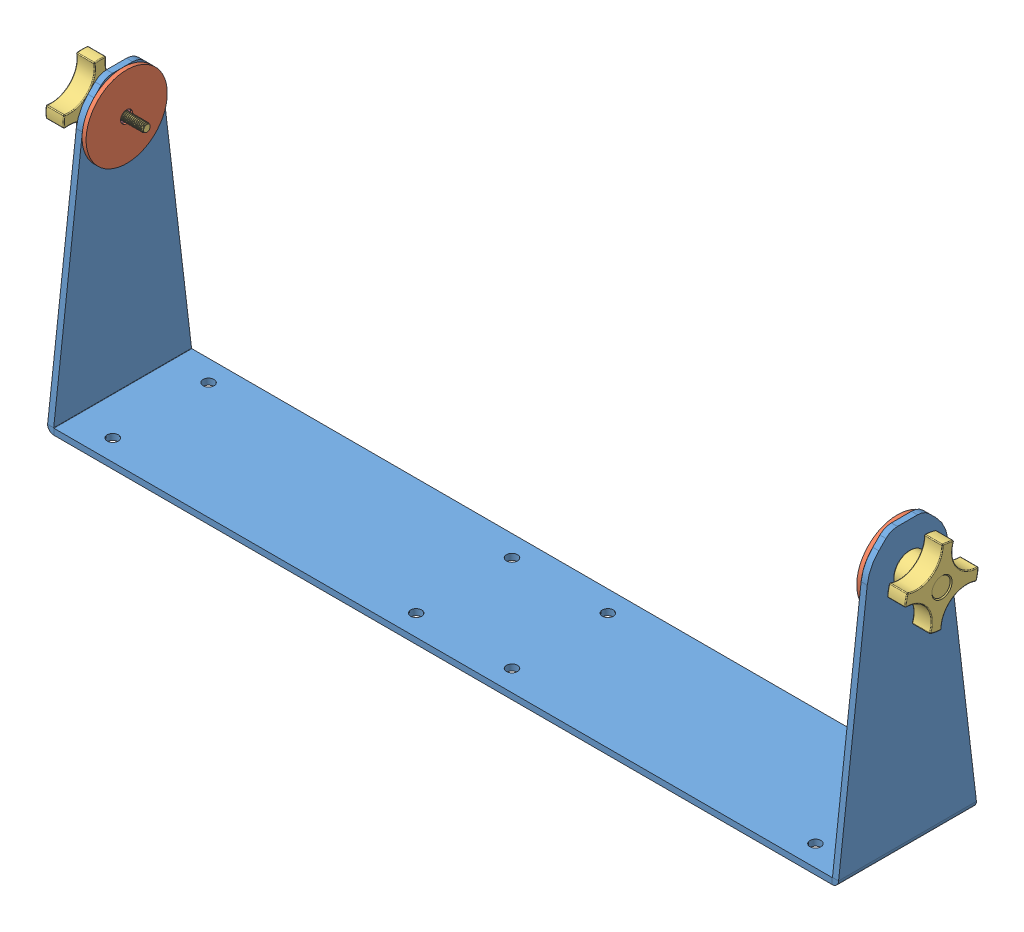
SolidWorks assembly All Wall Yoke Configurations, YWxx.SLDASM, configuration YW23.8 (file format 13000). Lengths in mm.
Overall size (673.13 227.28 107.95).
7 component instances, 4 part files, 12 mates.
Components (placement in the parent):
- All Wall Yoke Configurations, YWxx-1: All Wall Yoke Configurations, YWxx.SLDPRT [YW23.8] at origin size (619.12 222.25 107.95)
- Rubber Washer, 10177-1: Rubber Washer, 10177.sldprt [Default] at (-304.7873 382.5534 -179.6315) x (0 0 -1) z (1 0 0)
- Knob, 30053-1: Knob, 30053.sldprt [Default] at (-298.4627 190.5 0) x (0 0 1) z (-1 0 0)
- Rubber Washer, 10177-2: Rubber Washer, 10177.sldprt [Default] at (304.7873 46.9472 220.3283) x (0 -0.984808 0.173648) z (-1 0 0)
- Knob, 30053-2: Knob, 30053.sldprt [Default] at (298.4627 190.5 0) x (0 0.984808 -0.173648) z (1 0 0)
- Bushing, 30501-1: Bushing, 30501.sldprt [Default] at (-309.5625 190.5 0) x (0 0 1) z (-1 0 0)
- Bushing, 30501-2: Bushing, 30501.sldprt [Default] at (309.5625 190.5 0) x (0 0.984808 -0.173648) z (1 0 0)
Mates (geometry in assembly coordinates):
- Coincident1: coincident anti-aligned: plane of All Wall Yoke Configurations, YWxx-1 through (-304.7873 190.5 0) normal (1 0 0); plane of Rubber Washer, 10177-1 through (-304.7873 190.5 -2.5664) normal (-1 0 0)
- Concentric1: concentric aligned: cylinder of All Wall Yoke Configurations, YWxx-1 through (-309.5625 190.5 0) axis (1 0 0) radius 4.9657; cylinder of Rubber Washer, 10177-1 through (-304.7873 190.5 0) axis (1 0 0) radius 4.7625
- Distance1: distance = 1.6002 mm anti-aligned: plane of Knob, 30053-1 through (-311.1627 190.5 0) normal (1 0 0); plane of All Wall Yoke Configurations, YWxx-1 through (-309.5625 190.5 0) normal (-1 0 0)
- Concentric4: concentric aligned: cylinder of All Wall Yoke Configurations, YWxx-1 through (-309.5625 190.5 0) axis (1 0 0) radius 4.9657; circle of Knob, 30053-1
- Coincident5: coincident anti-aligned: plane of All Wall Yoke Configurations, YWxx-1 through (304.7873 190.5 0) normal (-1 0 0); plane of Rubber Washer, 10177-2 through (304.7873 187.9726 0.4456) normal (1 0 0)
- Concentric5: concentric aligned: cylinder of All Wall Yoke Configurations, YWxx-1 through (309.5625 190.5 0) axis (-1 0 0) radius 4.9657; cylinder of Rubber Washer, 10177-2 through (304.7873 190.5 0) axis (-1 0 0) radius 4.7625
- Distance2: distance = 1.6002 mm anti-aligned: plane of Knob, 30053-2 through (311.1627 190.5 0) normal (-1 0 0); plane of All Wall Yoke Configurations, YWxx-1 through (309.5625 190.5 0) normal (1 0 0)
- Concentric7: concentric aligned: cylinder of All Wall Yoke Configurations, YWxx-1 through (309.5625 190.5 0) axis (-1 0 0) radius 4.9657; circle of Knob, 30053-2
- Coincident6: coincident anti-aligned: plane of All Wall Yoke Configurations, YWxx-1 through (-309.5625 190.5 0) normal (-1 0 0); plane of Bushing, 30501-1 through (-309.5625 190.5 0) normal (1 0 0)
- Concentric8: concentric anti-aligned: cylinder of All Wall Yoke Configurations, YWxx-1 through (-309.5625 190.5 0) axis (1 0 0) radius 4.9657; cylinder of Bushing, 30501-1 through (-303.2125 190.5 0) axis (-1 0 0) radius 3.302
- Coincident7: coincident anti-aligned: plane of All Wall Yoke Configurations, YWxx-1 through (309.5625 190.5 0) normal (1 0 0); plane of Bushing, 30501-2 through (309.5625 190.5 0) normal (-1 0 0)
- Concentric9: concentric anti-aligned: cylinder of All Wall Yoke Configurations, YWxx-1 through (309.5625 190.5 0) axis (-1 0 0) radius 4.9657; cylinder of Bushing, 30501-2 through (303.2125 190.5 0) axis (1 0 0) radius 3.302
